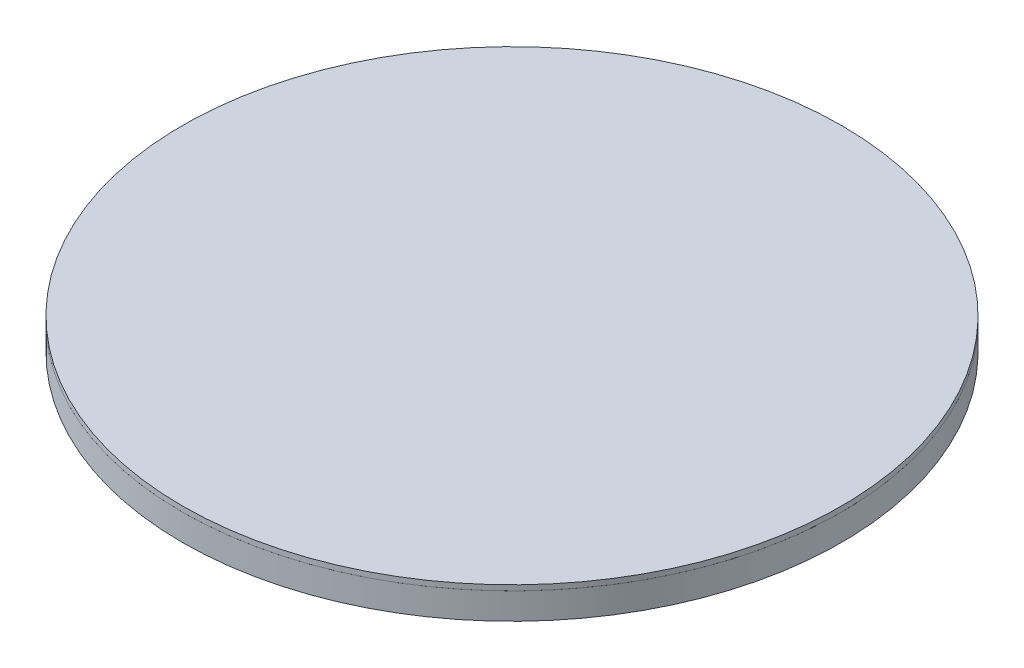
from build123d import *

# Parameters (mm, degrees)
SKETCH1_R           = 12.5
BOSS_EXTRUDE1_DEPTH = 1.2
CUT_EXTRUDE1_START  = -0.001
SKETCH3_R           = 12.5
SKETCH3_R_2         = 12
CUT_EXTRUDE1_DEPTH  = 0.001


with BuildPart() as part:
    # Sketch1 → Boss-Extrude1 (new body)
    with BuildSketch(Plane(origin=(0, 0, 0), x_dir=(1, 0, 0), z_dir=(0, 1, 0))):
        with Locations(Location((0, 0, 0), (0, 0, 270))):
            Circle(SKETCH1_R)
    extrude(amount=BOSS_EXTRUDE1_DEPTH)

    # Sketch3 → Cut-Extrude1 (cut)
    with BuildSketch(Plane(origin=(0, 1, 0), x_dir=(1, 0, 0), z_dir=(0, 1, 0)).offset(CUT_EXTRUDE1_START)):
        with Locations(Location((0, 0, 0), (0, 0, 270))):
            Circle(SKETCH3_R)
        with Locations(Location((0, 0, 0), (0, 0, 270))):
            Circle(SKETCH3_R_2, mode=Mode.SUBTRACT)
    extrude(amount=CUT_EXTRUDE1_DEPTH, mode=Mode.SUBTRACT)


solid = part.part
